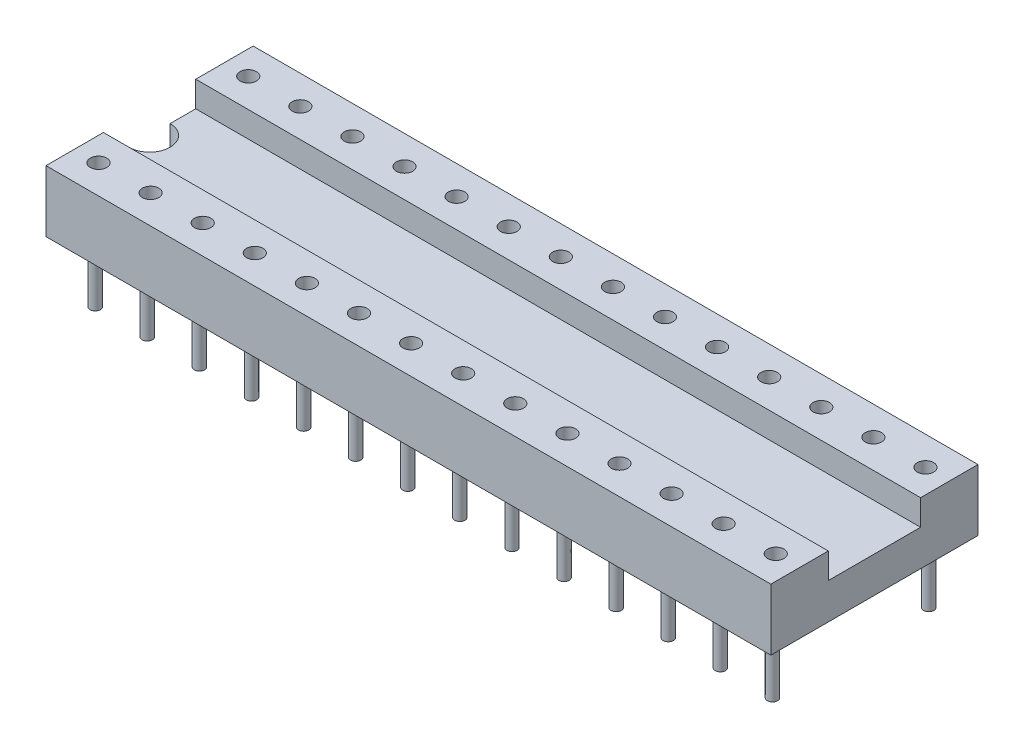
from build123d import *

# Parameters (mm, degrees)
EXTRUSION1_DEPTH        = 35.34
ENL_V_MAT_EXTRU_1_DEPTH = 36.741860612
ESQUISSE3_R             = 0.4
ENL_V_MAT_EXTRU_2_DEPTH = 2.5
ESQUISSE5_R             = 0.25
EXTRUSION2_DEPTH        = 3


with BuildPart() as part:
    # Esquisse1 → Extrusion1 (new body)
    with BuildSketch(Plane(origin=(0, 0, 0), x_dir=(0, 0, -1), z_dir=(1, 0, 0))):
        Polygon((-2.25, 1.75), (-2.25, 3), (-5.05, 3), (-5.05, 0), (5.05, 0), (5.05, 3), (2.25, 3), (2.25, 1.75), align=None)
    extrude(amount=EXTRUSION1_DEPTH)

    # Esquisse2 → Enl_v. mat.-Extru.1 (cut, through all)
    with BuildSketch(Plane(origin=(0, 1.75, 0), x_dir=(-1, 0, 0), z_dir=(0, 1, 0))):
        with BuildLine():
            Line((0, -1), (0, 1))
            ThreePointArc((0, 1), (-1, 0), (0, -1))
        make_face()
    extrude(amount=-ENL_V_MAT_EXTRU_1_DEPTH, mode=Mode.SUBTRACT)

    # Esquisse3 → Enl_v. mat.-Extru.2 (cut)
    with BuildSketch(Plane(origin=(0, 3, 0), x_dir=(-1, 0, 0), z_dir=(0, 1, 0))):
        with Locations(Location((-1.16, 3.65, 0), (0, 0, 90))):
            Circle(ESQUISSE3_R)
        with Locations(Location((-1.16, -3.65, 0), (0, 0, 270))):
            Circle(ESQUISSE3_R)
        with Locations(Location((-3.7, 3.65, 0), (0, 0, 90))):
            Circle(ESQUISSE3_R)
        with Locations(Location((-3.7, -3.65, 0), (0, 0, 270))):
            Circle(ESQUISSE3_R)
        with Locations(Location((-6.24, 3.65, 0), (0, 0, 90))):
            Circle(ESQUISSE3_R)
        with Locations(Location((-6.24, -3.65, 0), (0, 0, 270))):
            Circle(ESQUISSE3_R)
        with Locations(Location((-8.78, 3.65, 0), (0, 0, 90))):
            Circle(ESQUISSE3_R)
        with Locations(Location((-8.78, -3.65, 0), (0, 0, 270))):
            Circle(ESQUISSE3_R)
        with Locations(Location((-11.32, 3.65, 0), (0, 0, 90))):
            Circle(ESQUISSE3_R)
        with Locations(Location((-11.32, -3.65, 0), (0, 0, 270))):
            Circle(ESQUISSE3_R)
        with Locations(Location((-13.86, 3.65, 0), (0, 0, 90))):
            Circle(ESQUISSE3_R)
        with Locations(Location((-13.86, -3.65, 0), (0, 0, 270))):
            Circle(ESQUISSE3_R)
        with Locations(Location((-16.4, 3.65, 0), (0, 0, 90))):
            Circle(ESQUISSE3_R)
        with Locations(Location((-16.4, -3.65, 0), (0, 0, 270))):
            Circle(ESQUISSE3_R)
        with Locations(Location((-18.94, 3.65, 0), (0, 0, 90))):
            Circle(ESQUISSE3_R)
        with Locations(Location((-18.94, -3.65, 0), (0, 0, 270))):
            Circle(ESQUISSE3_R)
        with Locations(Location((-21.48, 3.65, 0), (0, 0, 90))):
            Circle(ESQUISSE3_R)
        with Locations(Location((-21.48, -3.65, 0), (0, 0, 270))):
            Circle(ESQUISSE3_R)
        with Locations(Location((-24.02, 3.65, 0), (0, 0, 90))):
            Circle(ESQUISSE3_R)
        with Locations(Location((-24.02, -3.65, 0), (0, 0, 270))):
            Circle(ESQUISSE3_R)
        with Locations(Location((-26.56, 3.65, 0), (0, 0, 90))):
            Circle(ESQUISSE3_R)
        with Locations(Location((-26.56, -3.65, 0), (0, 0, 270))):
            Circle(ESQUISSE3_R)
        with Locations(Location((-29.1, 3.65, 0), (0, 0, 90))):
            Circle(ESQUISSE3_R)
        with Locations(Location((-29.1, -3.65, 0), (0, 0, 270))):
            Circle(ESQUISSE3_R)
        with Locations(Location((-31.64, 3.65, 0), (0, 0, 90))):
            Circle(ESQUISSE3_R)
        with Locations(Location((-31.64, -3.65, 0), (0, 0, 270))):
            Circle(ESQUISSE3_R)
        with Locations(Location((-34.18, 3.65, 0), (0, 0, 90))):
            Circle(ESQUISSE3_R)
        with Locations(Location((-34.18, -3.65, 0), (0, 0, 270))):
            Circle(ESQUISSE3_R)
    extrude(amount=-ENL_V_MAT_EXTRU_2_DEPTH, mode=Mode.SUBTRACT)

    # Esquisse5 → Extrusion2 (add)
    with BuildSketch(Plane.XZ):
        with Locations(Location((1.16, 3.81, 0), (0, 0, 90))):
            Circle(ESQUISSE5_R)
        with Locations(Location((1.16, -3.81, 0), (0, 0, 90))):
            Circle(ESQUISSE5_R)
        with Locations(Location((3.7, -3.81, 0), (0, 0, 90))):
            Circle(ESQUISSE5_R)
        with Locations(Location((3.7, 3.81, 0), (0, 0, 90))):
            Circle(ESQUISSE5_R)
        with Locations(Location((6.24, -3.81, 0), (0, 0, 90))):
            Circle(ESQUISSE5_R)
        with Locations(Location((6.24, 3.81, 0), (0, 0, 90))):
            Circle(ESQUISSE5_R)
        with Locations(Location((8.78, -3.81, 0), (0, 0, 90))):
            Circle(ESQUISSE5_R)
        with Locations(Location((8.78, 3.81, 0), (0, 0, 90))):
            Circle(ESQUISSE5_R)
        with Locations(Location((11.32, -3.81, 0), (0, 0, 90))):
            Circle(ESQUISSE5_R)
        with Locations(Location((11.32, 3.81, 0), (0, 0, 90))):
            Circle(ESQUISSE5_R)
        with Locations(Location((13.86, -3.81, 0), (0, 0, 90))):
            Circle(ESQUISSE5_R)
        with Locations(Location((13.86, 3.81, 0), (0, 0, 90))):
            Circle(ESQUISSE5_R)
        with Locations(Location((16.4, -3.81, 0), (0, 0, 90))):
            Circle(ESQUISSE5_R)
        with Locations(Location((16.4, 3.81, 0), (0, 0, 90))):
            Circle(ESQUISSE5_R)
        with Locations(Location((18.94, -3.81, 0), (0, 0, 90))):
            Circle(ESQUISSE5_R)
        with Locations(Location((18.94, 3.81, 0), (0, 0, 90))):
            Circle(ESQUISSE5_R)
        with Locations(Location((21.48, -3.81, 0), (0, 0, 90))):
            Circle(ESQUISSE5_R)
        with Locations(Location((21.48, 3.81, 0), (0, 0, 90))):
            Circle(ESQUISSE5_R)
        with Locations(Location((24.02, -3.81, 0), (0, 0, 90))):
            Circle(ESQUISSE5_R)
        with Locations(Location((24.02, 3.81, 0), (0, 0, 90))):
            Circle(ESQUISSE5_R)
        with Locations(Location((26.56, -3.81, 0), (0, 0, 90))):
            Circle(ESQUISSE5_R)
        with Locations(Location((26.56, 3.81, 0), (0, 0, 90))):
            Circle(ESQUISSE5_R)
        with Locations(Location((29.1, -3.81, 0), (0, 0, 90))):
            Circle(ESQUISSE5_R)
        with Locations(Location((29.1, 3.81, 0), (0, 0, 90))):
            Circle(ESQUISSE5_R)
        with Locations(Location((31.64, -3.81, 0), (0, 0, 90))):
            Circle(ESQUISSE5_R)
        with Locations(Location((31.64, 3.81, 0), (0, 0, 90))):
            Circle(ESQUISSE5_R)
        with Locations(Location((34.18, -3.81, 0), (0, 0, 90))):
            Circle(ESQUISSE5_R)
        with Locations(Location((34.18, 3.81, 0), (0, 0, 90))):
            Circle(ESQUISSE5_R)
    extrude(amount=EXTRUSION2_DEPTH)


solid = part.part
